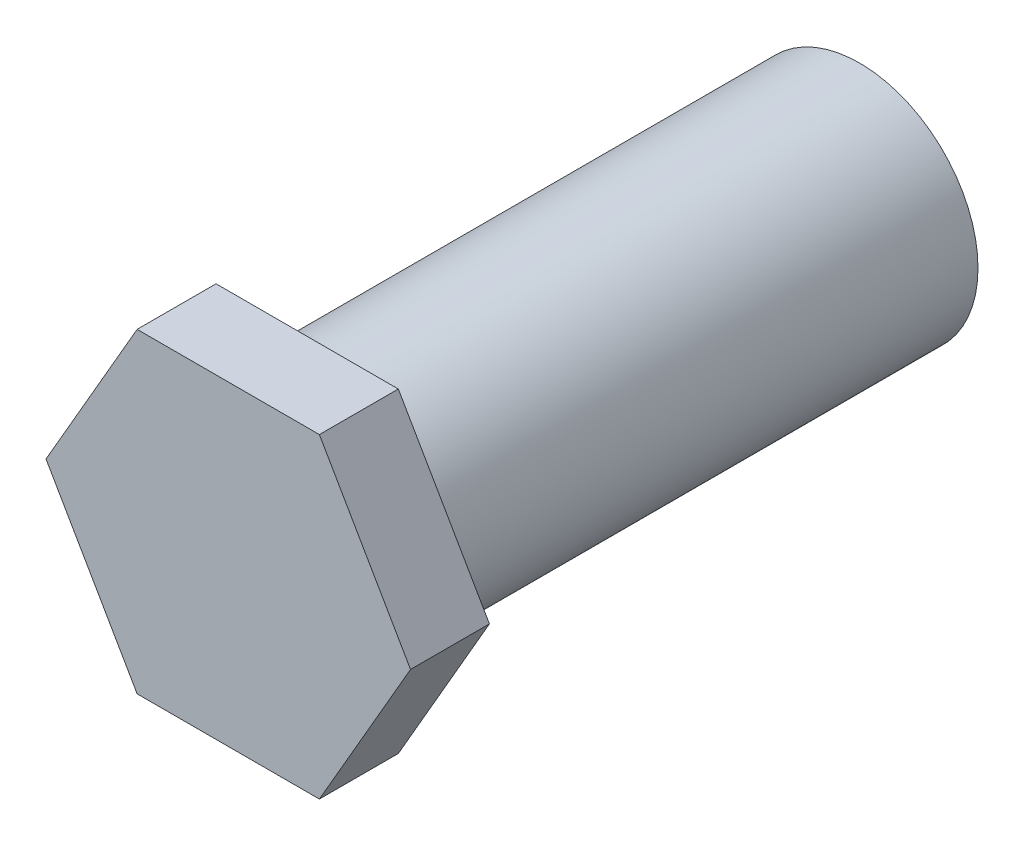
ISO-10303-21;
HEADER;
FILE_DESCRIPTION(('STEP AP214'),'2;1');
FILE_NAME('part.step','',(''),(''),'','','');
FILE_SCHEMA(('AUTOMOTIVE_DESIGN { 1 0 10303 214 1 1 1 1 }'));
ENDSEC;
DATA;
#1=APPLICATION_CONTEXT('core data for automotive mechanical design processes');
#2=APPLICATION_PROTOCOL_DEFINITION('international standard','automotive_design',2000,#1);
#3=PRODUCT_CONTEXT('',#1,'mechanical');
#4=PRODUCT('Part','Part','',(#3));
#5=PRODUCT_RELATED_PRODUCT_CATEGORY('part','',(#4));
#6=PRODUCT_DEFINITION_FORMATION('','',#4);
#7=PRODUCT_DEFINITION_CONTEXT('part definition',#1,'design');
#8=PRODUCT_DEFINITION('design','',#6,#7);
#9=PRODUCT_DEFINITION_SHAPE('','',#8);
#10=(LENGTH_UNIT() NAMED_UNIT(*) SI_UNIT(.MILLI.,.METRE.));
#11=(NAMED_UNIT(*) PLANE_ANGLE_UNIT() SI_UNIT($,.RADIAN.));
#12=(NAMED_UNIT(*) SI_UNIT($,.STERADIAN.) SOLID_ANGLE_UNIT());
#13=UNCERTAINTY_MEASURE_WITH_UNIT(LENGTH_MEASURE(1.E-05),#10,'distance_accuracy_value','');
#14=(GEOMETRIC_REPRESENTATION_CONTEXT(3) GLOBAL_UNCERTAINTY_ASSIGNED_CONTEXT((#13)) GLOBAL_UNIT_ASSIGNED_CONTEXT((#10,
#11,#12)) REPRESENTATION_CONTEXT('',''));
#15=CARTESIAN_POINT('',(0.,0.,0.));
#16=DIRECTION('',(0.,0.,1.));
#17=DIRECTION('',(1.,0.,0.));
#18=AXIS2_PLACEMENT_3D('',#15,#16,#17);
#19=CARTESIAN_POINT('',(0.,0.,35.));
#20=DIRECTION('',(0.,0.,-1.));
#21=DIRECTION('',(-1.,0.,0.));
#22=AXIS2_PLACEMENT_3D('',#19,#20,#21);
#23=CYLINDRICAL_SURFACE('',#22,7.5);
#24=CARTESIAN_POINT('',(0.,0.,35.));
#25=DIRECTION('',(0.,0.,1.));
#26=DIRECTION('',(1.,0.,0.));
#27=AXIS2_PLACEMENT_3D('',#24,#25,#26);
#28=CIRCLE('',#27,7.5);
#29=CARTESIAN_POINT('',(7.5,0.,35.));
#30=VERTEX_POINT('',#29);
#31=EDGE_CURVE('E11',#30,#30,#28,.T.);
#32=ORIENTED_EDGE('',*,*,#31,.F.);
#33=EDGE_LOOP('',(#32));
#34=FACE_BOUND('',#33,.T.);
#35=CARTESIAN_POINT('',(0.,0.,0.));
#36=DIRECTION('',(0.,0.,1.));
#37=DIRECTION('',(1.,0.,0.));
#38=AXIS2_PLACEMENT_3D('',#35,#36,#37);
#39=CIRCLE('',#38,7.5);
#40=CARTESIAN_POINT('',(7.5,0.,0.));
#41=VERTEX_POINT('',#40);
#42=EDGE_CURVE('E357',#41,#41,#39,.T.);
#43=ORIENTED_EDGE('',*,*,#42,.T.);
#44=EDGE_LOOP('',(#43));
#45=FACE_BOUND('',#44,.T.);
#46=ADVANCED_FACE('F350',(#34,#45),#23,.T.);
#47=CARTESIAN_POINT('',(0.,0.,0.));
#48=DIRECTION('',(0.,0.,1.));
#49=DIRECTION('',(1.,0.,0.));
#50=AXIS2_PLACEMENT_3D('',#47,#48,#49);
#51=PLANE('',#50);
#52=ORIENTED_EDGE('',*,*,#42,.F.);
#53=EDGE_LOOP('',(#52));
#54=FACE_BOUND('',#53,.T.);
#55=ADVANCED_FACE('F458',(#54),#51,.F.);
#56=CARTESIAN_POINT('',(11.5470053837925,0.,35.));
#57=DIRECTION('',(0.,0.,1.));
#58=DIRECTION('',(1.,0.,0.));
#59=AXIS2_PLACEMENT_3D('',#56,#57,#58);
#60=PLANE('',#59);
#61=DIRECTION('',(0.5,0.866025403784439,0.));
#62=VECTOR('',#61,1.);
#63=CARTESIAN_POINT('',(5.77350269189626,-10.,35.));
#64=LINE('',#63,#62);
#65=CARTESIAN_POINT('',(5.77350269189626,-10.,35.));
#66=VERTEX_POINT('',#65);
#67=CARTESIAN_POINT('',(11.5470053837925,0.,35.));
#68=VERTEX_POINT('',#67);
#69=EDGE_CURVE('E408',#66,#68,#64,.T.);
#70=ORIENTED_EDGE('',*,*,#69,.F.);
#71=DIRECTION('',(1.,0.,0.));
#72=VECTOR('',#71,1.);
#73=CARTESIAN_POINT('',(-5.77350269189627,-10.,35.));
#74=LINE('',#73,#72);
#75=CARTESIAN_POINT('',(-5.77350269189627,-10.,35.));
#76=VERTEX_POINT('',#75);
#77=EDGE_CURVE('E433',#76,#66,#74,.T.);
#78=ORIENTED_EDGE('',*,*,#77,.F.);
#79=DIRECTION('',(0.5,-0.866025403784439,0.));
#80=VECTOR('',#79,1.);
#81=CARTESIAN_POINT('',(-11.5470053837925,0.,35.));
#82=LINE('',#81,#80);
#83=CARTESIAN_POINT('',(-11.5470053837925,0.,35.));
#84=VERTEX_POINT('',#83);
#85=EDGE_CURVE('E431',#84,#76,#82,.T.);
#86=ORIENTED_EDGE('',*,*,#85,.F.);
#87=DIRECTION('',(-0.5,-0.866025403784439,0.));
#88=VECTOR('',#87,1.);
#89=CARTESIAN_POINT('',(-5.77350269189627,10.,35.));
#90=LINE('',#89,#88);
#91=CARTESIAN_POINT('',(-5.77350269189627,10.,35.));
#92=VERTEX_POINT('',#91);
#93=EDGE_CURVE('E429',#92,#84,#90,.T.);
#94=ORIENTED_EDGE('',*,*,#93,.F.);
#95=DIRECTION('',(-1.,0.,0.));
#96=VECTOR('',#95,1.);
#97=CARTESIAN_POINT('',(5.77350269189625,10.,35.));
#98=LINE('',#97,#96);
#99=CARTESIAN_POINT('',(5.77350269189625,10.,35.));
#100=VERTEX_POINT('',#99);
#101=EDGE_CURVE('E410',#100,#92,#98,.T.);
#102=ORIENTED_EDGE('',*,*,#101,.F.);
#103=DIRECTION('',(-0.5,0.866025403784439,0.));
#104=VECTOR('',#103,1.);
#105=CARTESIAN_POINT('',(11.5470053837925,0.,35.));
#106=LINE('',#105,#104);
#107=EDGE_CURVE('E402',#68,#100,#106,.T.);
#108=ORIENTED_EDGE('',*,*,#107,.F.);
#109=EDGE_LOOP('',(#70,#78,#86,#94,#102,#108));
#110=FACE_BOUND('',#109,.T.);
#111=ORIENTED_EDGE('',*,*,#31,.T.);
#112=EDGE_LOOP('',(#111));
#113=FACE_BOUND('',#112,.T.);
#114=ADVANCED_FACE('F404',(#110,#113),#60,.F.);
#115=CARTESIAN_POINT('',(5.77350269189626,-10.,40.));
#116=DIRECTION('',(-0.866025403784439,0.5,0.));
#117=DIRECTION('',(-0.5,-0.866025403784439,0.));
#118=AXIS2_PLACEMENT_3D('',#115,#116,#117);
#119=PLANE('',#118);
#120=ORIENTED_EDGE('',*,*,#69,.T.);
#121=DIRECTION('',(0.,0.,-1.));
#122=VECTOR('',#121,1.);
#123=CARTESIAN_POINT('',(11.5470053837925,0.,40.));
#124=LINE('',#123,#122);
#125=CARTESIAN_POINT('',(11.5470053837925,0.,40.));
#126=VERTEX_POINT('',#125);
#127=EDGE_CURVE('E416',#126,#68,#124,.T.);
#128=ORIENTED_EDGE('',*,*,#127,.F.);
#129=DIRECTION('',(0.5,0.866025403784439,0.));
#130=VECTOR('',#129,1.);
#131=CARTESIAN_POINT('',(5.77350269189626,-10.,40.));
#132=LINE('',#131,#130);
#133=CARTESIAN_POINT('',(5.77350269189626,-10.,40.));
#134=VERTEX_POINT('',#133);
#135=EDGE_CURVE('E435',#134,#126,#132,.T.);
#136=ORIENTED_EDGE('',*,*,#135,.F.);
#137=DIRECTION('',(0.,0.,-1.));
#138=VECTOR('',#137,1.);
#139=CARTESIAN_POINT('',(5.77350269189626,-10.,40.));
#140=LINE('',#139,#138);
#141=EDGE_CURVE('E425',#134,#66,#140,.T.);
#142=ORIENTED_EDGE('',*,*,#141,.T.);
#143=EDGE_LOOP('',(#120,#128,#136,#142));
#144=FACE_BOUND('',#143,.T.);
#145=ADVANCED_FACE('F424',(#144),#119,.F.);
#146=CARTESIAN_POINT('',(11.5470053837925,0.,40.));
#147=DIRECTION('',(-0.866025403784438,-0.5,0.));
#148=DIRECTION('',(0.5,-0.866025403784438,0.));
#149=AXIS2_PLACEMENT_3D('',#146,#147,#148);
#150=PLANE('',#149);
#151=ORIENTED_EDGE('',*,*,#107,.T.);
#152=DIRECTION('',(0.,0.,-1.));
#153=VECTOR('',#152,1.);
#154=CARTESIAN_POINT('',(5.77350269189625,10.,40.));
#155=LINE('',#154,#153);
#156=CARTESIAN_POINT('',(5.77350269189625,10.,40.));
#157=VERTEX_POINT('',#156);
#158=EDGE_CURVE('E421',#157,#100,#155,.T.);
#159=ORIENTED_EDGE('',*,*,#158,.F.);
#160=DIRECTION('',(-0.5,0.866025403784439,0.));
#161=VECTOR('',#160,1.);
#162=CARTESIAN_POINT('',(11.5470053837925,0.,40.));
#163=LINE('',#162,#161);
#164=EDGE_CURVE('E418',#126,#157,#163,.T.);
#165=ORIENTED_EDGE('',*,*,#164,.F.);
#166=ORIENTED_EDGE('',*,*,#127,.T.);
#167=EDGE_LOOP('',(#151,#159,#165,#166));
#168=FACE_BOUND('',#167,.T.);
#169=ADVANCED_FACE('F417',(#168),#150,.F.);
#170=CARTESIAN_POINT('',(5.77350269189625,10.,40.));
#171=DIRECTION('',(0.,-1.,0.));
#172=DIRECTION('',(0.,0.,-1.));
#173=AXIS2_PLACEMENT_3D('',#170,#171,#172);
#174=PLANE('',#173);
#175=ORIENTED_EDGE('',*,*,#101,.T.);
#176=DIRECTION('',(0.,0.,-1.));
#177=VECTOR('',#176,1.);
#178=CARTESIAN_POINT('',(-5.77350269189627,10.,40.));
#179=LINE('',#178,#177);
#180=CARTESIAN_POINT('',(-5.77350269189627,10.,40.));
#181=VERTEX_POINT('',#180);
#182=EDGE_CURVE('E451',#181,#92,#179,.T.);
#183=ORIENTED_EDGE('',*,*,#182,.F.);
#184=DIRECTION('',(-1.,0.,0.));
#185=VECTOR('',#184,1.);
#186=CARTESIAN_POINT('',(5.77350269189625,10.,40.));
#187=LINE('',#186,#185);
#188=EDGE_CURVE('E438',#157,#181,#187,.T.);
#189=ORIENTED_EDGE('',*,*,#188,.F.);
#190=ORIENTED_EDGE('',*,*,#158,.T.);
#191=EDGE_LOOP('',(#175,#183,#189,#190));
#192=FACE_BOUND('',#191,.T.);
#193=ADVANCED_FACE('F471',(#192),#174,.F.);
#194=CARTESIAN_POINT('',(-5.77350269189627,10.,40.));
#195=DIRECTION('',(0.866025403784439,-0.5,0.));
#196=DIRECTION('',(0.5,0.866025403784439,0.));
#197=AXIS2_PLACEMENT_3D('',#194,#195,#196);
#198=PLANE('',#197);
#199=ORIENTED_EDGE('',*,*,#93,.T.);
#200=DIRECTION('',(0.,0.,-1.));
#201=VECTOR('',#200,1.);
#202=CARTESIAN_POINT('',(-11.5470053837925,0.,40.));
#203=LINE('',#202,#201);
#204=CARTESIAN_POINT('',(-11.5470053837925,0.,40.));
#205=VERTEX_POINT('',#204);
#206=EDGE_CURVE('E448',#205,#84,#203,.T.);
#207=ORIENTED_EDGE('',*,*,#206,.F.);
#208=DIRECTION('',(-0.5,-0.866025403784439,0.));
#209=VECTOR('',#208,1.);
#210=CARTESIAN_POINT('',(-5.77350269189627,10.,40.));
#211=LINE('',#210,#209);
#212=EDGE_CURVE('E440',#181,#205,#211,.T.);
#213=ORIENTED_EDGE('',*,*,#212,.F.);
#214=ORIENTED_EDGE('',*,*,#182,.T.);
#215=EDGE_LOOP('',(#199,#207,#213,#214));
#216=FACE_BOUND('',#215,.T.);
#217=ADVANCED_FACE('F474',(#216),#198,.F.);
#218=CARTESIAN_POINT('',(-11.5470053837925,0.,40.));
#219=DIRECTION('',(0.866025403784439,0.5,0.));
#220=DIRECTION('',(-0.5,0.866025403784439,0.));
#221=AXIS2_PLACEMENT_3D('',#218,#219,#220);
#222=PLANE('',#221);
#223=ORIENTED_EDGE('',*,*,#85,.T.);
#224=DIRECTION('',(0.,0.,-1.));
#225=VECTOR('',#224,1.);
#226=CARTESIAN_POINT('',(-5.77350269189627,-10.,40.));
#227=LINE('',#226,#225);
#228=CARTESIAN_POINT('',(-5.77350269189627,-10.,40.));
#229=VERTEX_POINT('',#228);
#230=EDGE_CURVE('E445',#229,#76,#227,.T.);
#231=ORIENTED_EDGE('',*,*,#230,.F.);
#232=DIRECTION('',(0.5,-0.866025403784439,0.));
#233=VECTOR('',#232,1.);
#234=CARTESIAN_POINT('',(-11.5470053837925,0.,40.));
#235=LINE('',#234,#233);
#236=EDGE_CURVE('E369',#205,#229,#235,.T.);
#237=ORIENTED_EDGE('',*,*,#236,.F.);
#238=ORIENTED_EDGE('',*,*,#206,.T.);
#239=EDGE_LOOP('',(#223,#231,#237,#238));
#240=FACE_BOUND('',#239,.T.);
#241=ADVANCED_FACE('F478',(#240),#222,.F.);
#242=CARTESIAN_POINT('',(-5.77350269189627,-10.,40.));
#243=DIRECTION('',(0.,1.,0.));
#244=DIRECTION('',(-1.,0.,0.));
#245=AXIS2_PLACEMENT_3D('',#242,#243,#244);
#246=PLANE('',#245);
#247=ORIENTED_EDGE('',*,*,#77,.T.);
#248=ORIENTED_EDGE('',*,*,#141,.F.);
#249=DIRECTION('',(1.,0.,0.));
#250=VECTOR('',#249,1.);
#251=CARTESIAN_POINT('',(-5.77350269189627,-10.,40.));
#252=LINE('',#251,#250);
#253=EDGE_CURVE('E364',#229,#134,#252,.T.);
#254=ORIENTED_EDGE('',*,*,#253,.F.);
#255=ORIENTED_EDGE('',*,*,#230,.T.);
#256=EDGE_LOOP('',(#247,#248,#254,#255));
#257=FACE_BOUND('',#256,.T.);
#258=ADVANCED_FACE('F482',(#257),#246,.F.);
#259=CARTESIAN_POINT('',(11.5470053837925,0.,40.));
#260=DIRECTION('',(0.,0.,1.));
#261=DIRECTION('',(1.,0.,0.));
#262=AXIS2_PLACEMENT_3D('',#259,#260,#261);
#263=PLANE('',#262);
#264=ORIENTED_EDGE('',*,*,#135,.T.);
#265=ORIENTED_EDGE('',*,*,#164,.T.);
#266=ORIENTED_EDGE('',*,*,#188,.T.);
#267=ORIENTED_EDGE('',*,*,#212,.T.);
#268=ORIENTED_EDGE('',*,*,#236,.T.);
#269=ORIENTED_EDGE('',*,*,#253,.T.);
#270=EDGE_LOOP('',(#264,#265,#266,#267,#268,#269));
#271=FACE_BOUND('',#270,.T.);
#272=ADVANCED_FACE('F486',(#271),#263,.T.);
#273=CLOSED_SHELL('',(#46,#55,#114,#145,#169,#193,#217,#241,#258,#272));
#274=MANIFOLD_SOLID_BREP('B2',#273);
#275=ADVANCED_BREP_SHAPE_REPRESENTATION('',(#18,#274),#14);
#276=SHAPE_DEFINITION_REPRESENTATION(#9,#275);
ENDSEC;
END-ISO-10303-21;
